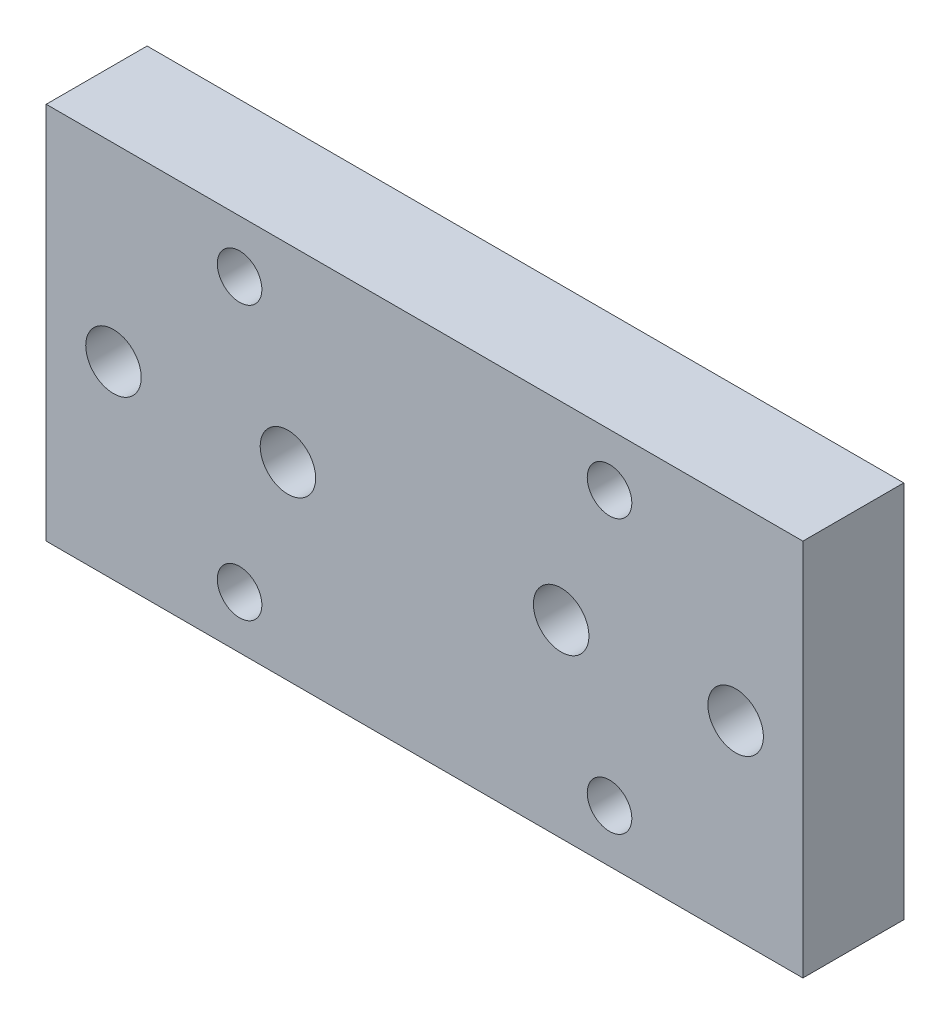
ISO-10303-21;
HEADER;
FILE_DESCRIPTION(('STEP AP214'),'2;1');
FILE_NAME('part.step','',(''),(''),'','','');
FILE_SCHEMA(('AUTOMOTIVE_DESIGN { 1 0 10303 214 1 1 1 1 }'));
ENDSEC;
DATA;
#1=APPLICATION_CONTEXT('core data for automotive mechanical design processes');
#2=APPLICATION_PROTOCOL_DEFINITION('international standard','automotive_design',2000,#1);
#3=PRODUCT_CONTEXT('',#1,'mechanical');
#4=PRODUCT('Part','Part','',(#3));
#5=PRODUCT_RELATED_PRODUCT_CATEGORY('part','',(#4));
#6=PRODUCT_DEFINITION_FORMATION('','',#4);
#7=PRODUCT_DEFINITION_CONTEXT('part definition',#1,'design');
#8=PRODUCT_DEFINITION('design','',#6,#7);
#9=PRODUCT_DEFINITION_SHAPE('','',#8);
#10=(LENGTH_UNIT() NAMED_UNIT(*) SI_UNIT(.MILLI.,.METRE.));
#11=(NAMED_UNIT(*) PLANE_ANGLE_UNIT() SI_UNIT($,.RADIAN.));
#12=(NAMED_UNIT(*) SI_UNIT($,.STERADIAN.) SOLID_ANGLE_UNIT());
#13=UNCERTAINTY_MEASURE_WITH_UNIT(LENGTH_MEASURE(1.E-05),#10,'distance_accuracy_value','');
#14=(GEOMETRIC_REPRESENTATION_CONTEXT(3) GLOBAL_UNCERTAINTY_ASSIGNED_CONTEXT((#13)) GLOBAL_UNIT_ASSIGNED_CONTEXT((#10,
#11,#12)) REPRESENTATION_CONTEXT('',''));
#15=CARTESIAN_POINT('',(0.,0.,0.));
#16=DIRECTION('',(0.,0.,1.));
#17=DIRECTION('',(1.,0.,0.));
#18=AXIS2_PLACEMENT_3D('',#15,#16,#17);
#19=CARTESIAN_POINT('',(-45.0000000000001,-22.5,12.));
#20=DIRECTION('',(0.,0.,1.));
#21=DIRECTION('',(1.,0.,0.));
#22=AXIS2_PLACEMENT_3D('',#19,#20,#21);
#23=PLANE('',#22);
#24=CARTESIAN_POINT('',(-22.,-16.25,12.));
#25=DIRECTION('',(0.,0.,-1.));
#26=DIRECTION('',(-1.,0.,0.));
#27=AXIS2_PLACEMENT_3D('',#24,#25,#26);
#28=CIRCLE('',#27,2.65);
#29=CARTESIAN_POINT('',(-24.65,-16.25,12.));
#30=VERTEX_POINT('',#29);
#31=EDGE_CURVE('E451',#30,#30,#28,.T.);
#32=ORIENTED_EDGE('',*,*,#31,.T.);
#33=EDGE_LOOP('',(#32));
#34=FACE_BOUND('',#33,.T.);
#35=CARTESIAN_POINT('',(22.,16.25,12.));
#36=DIRECTION('',(0.,0.,-1.));
#37=DIRECTION('',(-1.,0.,0.));
#38=AXIS2_PLACEMENT_3D('',#35,#36,#37);
#39=CIRCLE('',#38,2.65);
#40=CARTESIAN_POINT('',(19.35,16.25,12.));
#41=VERTEX_POINT('',#40);
#42=EDGE_CURVE('E463',#41,#41,#39,.T.);
#43=ORIENTED_EDGE('',*,*,#42,.T.);
#44=EDGE_LOOP('',(#43));
#45=FACE_BOUND('',#44,.T.);
#46=CARTESIAN_POINT('',(-37.,0.,12.));
#47=DIRECTION('',(0.,0.,-1.));
#48=DIRECTION('',(-1.,0.,0.));
#49=AXIS2_PLACEMENT_3D('',#46,#47,#48);
#50=CIRCLE('',#49,3.3);
#51=CARTESIAN_POINT('',(-40.3,0.,12.));
#52=VERTEX_POINT('',#51);
#53=EDGE_CURVE('E479',#52,#52,#50,.T.);
#54=ORIENTED_EDGE('',*,*,#53,.T.);
#55=EDGE_LOOP('',(#54));
#56=FACE_BOUND('',#55,.T.);
#57=CARTESIAN_POINT('',(16.25,0.,12.));
#58=DIRECTION('',(0.,0.,-1.));
#59=DIRECTION('',(-1.,0.,0.));
#60=AXIS2_PLACEMENT_3D('',#57,#58,#59);
#61=CIRCLE('',#60,3.3);
#62=CARTESIAN_POINT('',(12.95,0.,12.));
#63=VERTEX_POINT('',#62);
#64=EDGE_CURVE('E501',#63,#63,#61,.T.);
#65=ORIENTED_EDGE('',*,*,#64,.T.);
#66=EDGE_LOOP('',(#65));
#67=FACE_BOUND('',#66,.T.);
#68=DIRECTION('',(0.,-1.,0.));
#69=VECTOR('',#68,1.);
#70=CARTESIAN_POINT('',(-45.,22.5,12.));
#71=LINE('',#70,#69);
#72=CARTESIAN_POINT('',(-45.,22.5,12.));
#73=VERTEX_POINT('',#72);
#74=CARTESIAN_POINT('',(-45.0000000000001,-22.5,12.));
#75=VERTEX_POINT('',#74);
#76=EDGE_CURVE('E416',#73,#75,#71,.T.);
#77=ORIENTED_EDGE('',*,*,#76,.T.);
#78=DIRECTION('',(1.,0.,0.));
#79=VECTOR('',#78,1.);
#80=CARTESIAN_POINT('',(-45.0000000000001,-22.5,12.));
#81=LINE('',#80,#79);
#82=CARTESIAN_POINT('',(44.9999999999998,-22.5,12.));
#83=VERTEX_POINT('',#82);
#84=EDGE_CURVE('E401',#75,#83,#81,.T.);
#85=ORIENTED_EDGE('',*,*,#84,.T.);
#86=DIRECTION('',(0.,1.,0.));
#87=VECTOR('',#86,1.);
#88=CARTESIAN_POINT('',(45.,22.5,12.));
#89=LINE('',#88,#87);
#90=CARTESIAN_POINT('',(45.,22.5,12.));
#91=VERTEX_POINT('',#90);
#92=EDGE_CURVE('E368',#83,#91,#89,.T.);
#93=ORIENTED_EDGE('',*,*,#92,.T.);
#94=DIRECTION('',(-1.,0.,0.));
#95=VECTOR('',#94,1.);
#96=CARTESIAN_POINT('',(-45.,22.5,12.));
#97=LINE('',#96,#95);
#98=EDGE_CURVE('E363',#91,#73,#97,.T.);
#99=ORIENTED_EDGE('',*,*,#98,.T.);
#100=EDGE_LOOP('',(#77,#85,#93,#99));
#101=FACE_BOUND('',#100,.T.);
#102=CARTESIAN_POINT('',(-16.25,0.,12.));
#103=DIRECTION('',(0.,0.,-1.));
#104=DIRECTION('',(-1.,0.,0.));
#105=AXIS2_PLACEMENT_3D('',#102,#103,#104);
#106=CIRCLE('',#105,3.3);
#107=CARTESIAN_POINT('',(-19.55,0.,12.));
#108=VERTEX_POINT('',#107);
#109=EDGE_CURVE('E435',#108,#108,#106,.T.);
#110=ORIENTED_EDGE('',*,*,#109,.T.);
#111=EDGE_LOOP('',(#110));
#112=FACE_BOUND('',#111,.T.);
#113=CARTESIAN_POINT('',(37.,0.,12.));
#114=DIRECTION('',(0.,0.,-1.));
#115=DIRECTION('',(-1.,0.,0.));
#116=AXIS2_PLACEMENT_3D('',#113,#114,#115);
#117=CIRCLE('',#116,3.3);
#118=CARTESIAN_POINT('',(33.7,0.,12.));
#119=VERTEX_POINT('',#118);
#120=EDGE_CURVE('E439',#119,#119,#117,.T.);
#121=ORIENTED_EDGE('',*,*,#120,.T.);
#122=EDGE_LOOP('',(#121));
#123=FACE_BOUND('',#122,.T.);
#124=CARTESIAN_POINT('',(22.,-16.25,12.));
#125=DIRECTION('',(0.,0.,-1.));
#126=DIRECTION('',(-1.,0.,0.));
#127=AXIS2_PLACEMENT_3D('',#124,#125,#126);
#128=CIRCLE('',#127,2.65);
#129=CARTESIAN_POINT('',(19.35,-16.25,12.));
#130=VERTEX_POINT('',#129);
#131=EDGE_CURVE('E443',#130,#130,#128,.T.);
#132=ORIENTED_EDGE('',*,*,#131,.T.);
#133=EDGE_LOOP('',(#132));
#134=FACE_BOUND('',#133,.T.);
#135=CARTESIAN_POINT('',(-22.,16.25,12.));
#136=DIRECTION('',(0.,0.,-1.));
#137=DIRECTION('',(-1.,0.,0.));
#138=AXIS2_PLACEMENT_3D('',#135,#136,#137);
#139=CIRCLE('',#138,2.65);
#140=CARTESIAN_POINT('',(-24.65,16.25,12.));
#141=VERTEX_POINT('',#140);
#142=EDGE_CURVE('E446',#141,#141,#139,.T.);
#143=ORIENTED_EDGE('',*,*,#142,.T.);
#144=EDGE_LOOP('',(#143));
#145=FACE_BOUND('',#144,.T.);
#146=ADVANCED_FACE('F348',(#34,#45,#56,#67,#101,#112,#123,#134,#145),#23,.T.);
#147=CARTESIAN_POINT('',(-45.,22.5,12.));
#148=DIRECTION('',(1.,0.,0.));
#149=DIRECTION('',(0.,0.,-1.));
#150=AXIS2_PLACEMENT_3D('',#147,#148,#149);
#151=PLANE('',#150);
#152=DIRECTION('',(0.,-1.,0.));
#153=VECTOR('',#152,1.);
#154=CARTESIAN_POINT('',(-45.,22.5,0.));
#155=LINE('',#154,#153);
#156=CARTESIAN_POINT('',(-45.,22.5,0.));
#157=VERTEX_POINT('',#156);
#158=CARTESIAN_POINT('',(-45.,-22.5,0.));
#159=VERTEX_POINT('',#158);
#160=EDGE_CURVE('E393',#157,#159,#155,.T.);
#161=ORIENTED_EDGE('',*,*,#160,.T.);
#162=DIRECTION('',(0.,0.,-1.));
#163=VECTOR('',#162,1.);
#164=CARTESIAN_POINT('',(-45.0000000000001,-22.5,12.));
#165=LINE('',#164,#163);
#166=EDGE_CURVE('E11',#75,#159,#165,.T.);
#167=ORIENTED_EDGE('',*,*,#166,.F.);
#168=ORIENTED_EDGE('',*,*,#76,.F.);
#169=DIRECTION('',(0.,0.,-1.));
#170=VECTOR('',#169,1.);
#171=CARTESIAN_POINT('',(-45.,22.5,12.));
#172=LINE('',#171,#170);
#173=EDGE_CURVE('E405',#73,#157,#172,.T.);
#174=ORIENTED_EDGE('',*,*,#173,.T.);
#175=EDGE_LOOP('',(#161,#167,#168,#174));
#176=FACE_BOUND('',#175,.T.);
#177=ADVANCED_FACE('F350',(#176),#151,.F.);
#178=CARTESIAN_POINT('',(-45.0000000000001,-22.5,12.));
#179=DIRECTION('',(0.,1.,0.));
#180=DIRECTION('',(-1.,0.,0.));
#181=AXIS2_PLACEMENT_3D('',#178,#179,#180);
#182=PLANE('',#181);
#183=DIRECTION('',(1.,0.,0.));
#184=VECTOR('',#183,1.);
#185=CARTESIAN_POINT('',(-45.,-22.5,0.));
#186=LINE('',#185,#184);
#187=CARTESIAN_POINT('',(45.,-22.5,0.));
#188=VERTEX_POINT('',#187);
#189=EDGE_CURVE('E389',#159,#188,#186,.T.);
#190=ORIENTED_EDGE('',*,*,#189,.T.);
#191=DIRECTION('',(0.,0.,-1.));
#192=VECTOR('',#191,1.);
#193=CARTESIAN_POINT('',(44.9999999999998,-22.5,12.));
#194=LINE('',#193,#192);
#195=EDGE_CURVE('E356',#83,#188,#194,.T.);
#196=ORIENTED_EDGE('',*,*,#195,.F.);
#197=ORIENTED_EDGE('',*,*,#84,.F.);
#198=ORIENTED_EDGE('',*,*,#166,.T.);
#199=EDGE_LOOP('',(#190,#196,#197,#198));
#200=FACE_BOUND('',#199,.T.);
#201=ADVANCED_FACE('F400',(#200),#182,.F.);
#202=CARTESIAN_POINT('',(45.,22.5,12.));
#203=DIRECTION('',(-1.,0.,0.));
#204=DIRECTION('',(0.,0.,1.));
#205=AXIS2_PLACEMENT_3D('',#202,#203,#204);
#206=PLANE('',#205);
#207=DIRECTION('',(0.,1.,0.));
#208=VECTOR('',#207,1.);
#209=CARTESIAN_POINT('',(45.,22.5,0.));
#210=LINE('',#209,#208);
#211=CARTESIAN_POINT('',(45.,22.5,0.));
#212=VERTEX_POINT('',#211);
#213=EDGE_CURVE('E394',#188,#212,#210,.T.);
#214=ORIENTED_EDGE('',*,*,#213,.T.);
#215=DIRECTION('',(0.,0.,-1.));
#216=VECTOR('',#215,1.);
#217=CARTESIAN_POINT('',(45.,22.5,12.));
#218=LINE('',#217,#216);
#219=EDGE_CURVE('E422',#91,#212,#218,.T.);
#220=ORIENTED_EDGE('',*,*,#219,.F.);
#221=ORIENTED_EDGE('',*,*,#92,.F.);
#222=ORIENTED_EDGE('',*,*,#195,.T.);
#223=EDGE_LOOP('',(#214,#220,#221,#222));
#224=FACE_BOUND('',#223,.T.);
#225=ADVANCED_FACE('F425',(#224),#206,.F.);
#226=CARTESIAN_POINT('',(-45.,22.5,12.));
#227=DIRECTION('',(0.,-1.,0.));
#228=DIRECTION('',(1.,0.,0.));
#229=AXIS2_PLACEMENT_3D('',#226,#227,#228);
#230=PLANE('',#229);
#231=DIRECTION('',(-1.,0.,0.));
#232=VECTOR('',#231,1.);
#233=CARTESIAN_POINT('',(-45.,22.5,0.));
#234=LINE('',#233,#232);
#235=EDGE_CURVE('E414',#212,#157,#234,.T.);
#236=ORIENTED_EDGE('',*,*,#235,.T.);
#237=ORIENTED_EDGE('',*,*,#173,.F.);
#238=ORIENTED_EDGE('',*,*,#98,.F.);
#239=ORIENTED_EDGE('',*,*,#219,.T.);
#240=EDGE_LOOP('',(#236,#237,#238,#239));
#241=FACE_BOUND('',#240,.T.);
#242=ADVANCED_FACE('F427',(#241),#230,.F.);
#243=CARTESIAN_POINT('',(-45.,-22.5,0.));
#244=DIRECTION('',(0.,0.,1.));
#245=DIRECTION('',(1.,0.,0.));
#246=AXIS2_PLACEMENT_3D('',#243,#244,#245);
#247=PLANE('',#246);
#248=CARTESIAN_POINT('',(-22.,16.25,0.));
#249=DIRECTION('',(0.,0.,-1.));
#250=DIRECTION('',(-1.,0.,0.));
#251=AXIS2_PLACEMENT_3D('',#248,#249,#250);
#252=CIRCLE('',#251,2.65);
#253=CARTESIAN_POINT('',(-24.65,16.25,0.));
#254=VERTEX_POINT('',#253);
#255=EDGE_CURVE('E448',#254,#254,#252,.T.);
#256=ORIENTED_EDGE('',*,*,#255,.F.);
#257=EDGE_LOOP('',(#256));
#258=FACE_BOUND('',#257,.T.);
#259=CARTESIAN_POINT('',(-22.,-16.25,0.));
#260=DIRECTION('',(0.,0.,-1.));
#261=DIRECTION('',(-1.,0.,0.));
#262=AXIS2_PLACEMENT_3D('',#259,#260,#261);
#263=CIRCLE('',#262,2.65);
#264=CARTESIAN_POINT('',(-24.65,-16.25,0.));
#265=VERTEX_POINT('',#264);
#266=EDGE_CURVE('E456',#265,#265,#263,.T.);
#267=ORIENTED_EDGE('',*,*,#266,.F.);
#268=EDGE_LOOP('',(#267));
#269=FACE_BOUND('',#268,.T.);
#270=CARTESIAN_POINT('',(22.,-16.25,0.));
#271=DIRECTION('',(0.,0.,-1.));
#272=DIRECTION('',(-1.,0.,0.));
#273=AXIS2_PLACEMENT_3D('',#270,#271,#272);
#274=CIRCLE('',#273,2.65);
#275=CARTESIAN_POINT('',(19.35,-16.25,0.));
#276=VERTEX_POINT('',#275);
#277=EDGE_CURVE('E460',#276,#276,#274,.T.);
#278=ORIENTED_EDGE('',*,*,#277,.F.);
#279=EDGE_LOOP('',(#278));
#280=FACE_BOUND('',#279,.T.);
#281=CARTESIAN_POINT('',(22.,16.25,0.));
#282=DIRECTION('',(0.,0.,-1.));
#283=DIRECTION('',(-1.,0.,0.));
#284=AXIS2_PLACEMENT_3D('',#281,#282,#283);
#285=CIRCLE('',#284,2.65);
#286=CARTESIAN_POINT('',(19.35,16.25,0.));
#287=VERTEX_POINT('',#286);
#288=EDGE_CURVE('E466',#287,#287,#285,.T.);
#289=ORIENTED_EDGE('',*,*,#288,.F.);
#290=EDGE_LOOP('',(#289));
#291=FACE_BOUND('',#290,.T.);
#292=CARTESIAN_POINT('',(37.,0.,0.));
#293=DIRECTION('',(0.,0.,-1.));
#294=DIRECTION('',(-1.,0.,0.));
#295=AXIS2_PLACEMENT_3D('',#292,#293,#294);
#296=CIRCLE('',#295,5.49999999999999);
#297=CARTESIAN_POINT('',(31.5,0.,0.));
#298=VERTEX_POINT('',#297);
#299=EDGE_CURVE('E476',#298,#298,#296,.T.);
#300=ORIENTED_EDGE('',*,*,#299,.F.);
#301=EDGE_LOOP('',(#300));
#302=FACE_BOUND('',#301,.T.);
#303=CARTESIAN_POINT('',(-37.,0.,0.));
#304=DIRECTION('',(0.,0.,-1.));
#305=DIRECTION('',(-1.,0.,0.));
#306=AXIS2_PLACEMENT_3D('',#303,#304,#305);
#307=CIRCLE('',#306,5.49999999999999);
#308=CARTESIAN_POINT('',(-42.5,0.,0.));
#309=VERTEX_POINT('',#308);
#310=EDGE_CURVE('E488',#309,#309,#307,.T.);
#311=ORIENTED_EDGE('',*,*,#310,.F.);
#312=EDGE_LOOP('',(#311));
#313=FACE_BOUND('',#312,.T.);
#314=CARTESIAN_POINT('',(-16.25,0.,0.));
#315=DIRECTION('',(0.,0.,-1.));
#316=DIRECTION('',(-1.,0.,0.));
#317=AXIS2_PLACEMENT_3D('',#314,#315,#316);
#318=CIRCLE('',#317,5.49999999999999);
#319=CARTESIAN_POINT('',(-21.75,0.,0.));
#320=VERTEX_POINT('',#319);
#321=EDGE_CURVE('E498',#320,#320,#318,.T.);
#322=ORIENTED_EDGE('',*,*,#321,.F.);
#323=EDGE_LOOP('',(#322));
#324=FACE_BOUND('',#323,.T.);
#325=CARTESIAN_POINT('',(16.25,0.,0.));
#326=DIRECTION('',(0.,0.,-1.));
#327=DIRECTION('',(-1.,0.,0.));
#328=AXIS2_PLACEMENT_3D('',#325,#326,#327);
#329=CIRCLE('',#328,5.49999999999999);
#330=CARTESIAN_POINT('',(10.75,0.,0.));
#331=VERTEX_POINT('',#330);
#332=EDGE_CURVE('E406',#331,#331,#329,.T.);
#333=ORIENTED_EDGE('',*,*,#332,.F.);
#334=EDGE_LOOP('',(#333));
#335=FACE_BOUND('',#334,.T.);
#336=ORIENTED_EDGE('',*,*,#160,.F.);
#337=ORIENTED_EDGE('',*,*,#235,.F.);
#338=ORIENTED_EDGE('',*,*,#213,.F.);
#339=ORIENTED_EDGE('',*,*,#189,.F.);
#340=EDGE_LOOP('',(#336,#337,#338,#339));
#341=FACE_BOUND('',#340,.T.);
#342=ADVANCED_FACE('F390',(#258,#269,#280,#291,#302,#313,#324,#335,#341),#247,.F.);
#343=CARTESIAN_POINT('',(16.25,0.,0.));
#344=DIRECTION('',(0.,0.,-1.));
#345=DIRECTION('',(-1.,0.,0.));
#346=AXIS2_PLACEMENT_3D('',#343,#344,#345);
#347=CYLINDRICAL_SURFACE('',#346,5.49999999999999);
#348=CARTESIAN_POINT('',(16.25,0.,6.00000000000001));
#349=DIRECTION('',(0.,0.,-1.));
#350=DIRECTION('',(-1.,0.,0.));
#351=AXIS2_PLACEMENT_3D('',#348,#349,#350);
#352=CIRCLE('',#351,5.49999999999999);
#353=CARTESIAN_POINT('',(10.75,0.,6.00000000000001));
#354=VERTEX_POINT('',#353);
#355=EDGE_CURVE('E409',#354,#354,#352,.T.);
#356=ORIENTED_EDGE('',*,*,#355,.F.);
#357=EDGE_LOOP('',(#356));
#358=FACE_BOUND('',#357,.T.);
#359=ORIENTED_EDGE('',*,*,#332,.T.);
#360=EDGE_LOOP('',(#359));
#361=FACE_BOUND('',#360,.T.);
#362=ADVANCED_FACE('F511',(#358,#361),#347,.F.);
#363=CARTESIAN_POINT('',(19.55,0.,6.00000000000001));
#364=DIRECTION('',(0.,0.,1.));
#365=DIRECTION('',(1.,0.,0.));
#366=AXIS2_PLACEMENT_3D('',#363,#364,#365);
#367=PLANE('',#366);
#368=CARTESIAN_POINT('',(16.25,0.,6.00000000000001));
#369=DIRECTION('',(0.,0.,-1.));
#370=DIRECTION('',(-1.,0.,0.));
#371=AXIS2_PLACEMENT_3D('',#368,#369,#370);
#372=CIRCLE('',#371,3.3);
#373=CARTESIAN_POINT('',(12.95,0.,6.00000000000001));
#374=VERTEX_POINT('',#373);
#375=EDGE_CURVE('E504',#374,#374,#372,.T.);
#376=ORIENTED_EDGE('',*,*,#375,.F.);
#377=EDGE_LOOP('',(#376));
#378=FACE_BOUND('',#377,.T.);
#379=ORIENTED_EDGE('',*,*,#355,.T.);
#380=EDGE_LOOP('',(#379));
#381=FACE_BOUND('',#380,.T.);
#382=ADVANCED_FACE('F509',(#378,#381),#367,.F.);
#383=CARTESIAN_POINT('',(16.25,0.,0.));
#384=DIRECTION('',(0.,0.,-1.));
#385=DIRECTION('',(-1.,0.,0.));
#386=AXIS2_PLACEMENT_3D('',#383,#384,#385);
#387=CYLINDRICAL_SURFACE('',#386,3.3);
#388=ORIENTED_EDGE('',*,*,#64,.F.);
#389=EDGE_LOOP('',(#388));
#390=FACE_BOUND('',#389,.T.);
#391=ORIENTED_EDGE('',*,*,#375,.T.);
#392=EDGE_LOOP('',(#391));
#393=FACE_BOUND('',#392,.T.);
#394=ADVANCED_FACE('F539',(#390,#393),#387,.F.);
#395=CARTESIAN_POINT('',(-16.25,0.,0.));
#396=DIRECTION('',(0.,0.,-1.));
#397=DIRECTION('',(-1.,0.,0.));
#398=AXIS2_PLACEMENT_3D('',#395,#396,#397);
#399=CYLINDRICAL_SURFACE('',#398,5.5);
#400=CARTESIAN_POINT('',(-16.25,0.,6.00000000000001));
#401=DIRECTION('',(0.,0.,-1.));
#402=DIRECTION('',(-1.,0.,0.));
#403=AXIS2_PLACEMENT_3D('',#400,#401,#402);
#404=CIRCLE('',#403,5.5);
#405=CARTESIAN_POINT('',(-21.75,0.,6.00000000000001));
#406=VERTEX_POINT('',#405);
#407=EDGE_CURVE('E495',#406,#406,#404,.T.);
#408=ORIENTED_EDGE('',*,*,#407,.F.);
#409=EDGE_LOOP('',(#408));
#410=FACE_BOUND('',#409,.T.);
#411=ORIENTED_EDGE('',*,*,#321,.T.);
#412=EDGE_LOOP('',(#411));
#413=FACE_BOUND('',#412,.T.);
#414=ADVANCED_FACE('F544',(#410,#413),#399,.F.);
#415=CARTESIAN_POINT('',(-12.95,0.,6.00000000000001));
#416=DIRECTION('',(0.,0.,1.));
#417=DIRECTION('',(1.,0.,0.));
#418=AXIS2_PLACEMENT_3D('',#415,#416,#417);
#419=PLANE('',#418);
#420=CARTESIAN_POINT('',(-16.25,0.,6.00000000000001));
#421=DIRECTION('',(0.,0.,-1.));
#422=DIRECTION('',(-1.,0.,0.));
#423=AXIS2_PLACEMENT_3D('',#420,#421,#422);
#424=CIRCLE('',#423,3.3);
#425=CARTESIAN_POINT('',(-19.55,0.,6.00000000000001));
#426=VERTEX_POINT('',#425);
#427=EDGE_CURVE('E492',#426,#426,#424,.T.);
#428=ORIENTED_EDGE('',*,*,#427,.F.);
#429=EDGE_LOOP('',(#428));
#430=FACE_BOUND('',#429,.T.);
#431=ORIENTED_EDGE('',*,*,#407,.T.);
#432=EDGE_LOOP('',(#431));
#433=FACE_BOUND('',#432,.T.);
#434=ADVANCED_FACE('F550',(#430,#433),#419,.F.);
#435=CARTESIAN_POINT('',(-16.25,0.,0.));
#436=DIRECTION('',(0.,0.,-1.));
#437=DIRECTION('',(-1.,0.,0.));
#438=AXIS2_PLACEMENT_3D('',#435,#436,#437);
#439=CYLINDRICAL_SURFACE('',#438,3.3);
#440=ORIENTED_EDGE('',*,*,#109,.F.);
#441=EDGE_LOOP('',(#440));
#442=FACE_BOUND('',#441,.T.);
#443=ORIENTED_EDGE('',*,*,#427,.T.);
#444=EDGE_LOOP('',(#443));
#445=FACE_BOUND('',#444,.T.);
#446=ADVANCED_FACE('F556',(#442,#445),#439,.F.);
#447=CARTESIAN_POINT('',(-37.,0.,0.));
#448=DIRECTION('',(0.,0.,-1.));
#449=DIRECTION('',(-1.,0.,0.));
#450=AXIS2_PLACEMENT_3D('',#447,#448,#449);
#451=CYLINDRICAL_SURFACE('',#450,5.49999999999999);
#452=CARTESIAN_POINT('',(-37.,0.,6.00000000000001));
#453=DIRECTION('',(0.,0.,-1.));
#454=DIRECTION('',(-1.,0.,0.));
#455=AXIS2_PLACEMENT_3D('',#452,#453,#454);
#456=CIRCLE('',#455,5.5);
#457=CARTESIAN_POINT('',(-42.5,0.,6.00000000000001));
#458=VERTEX_POINT('',#457);
#459=EDGE_CURVE('E485',#458,#458,#456,.T.);
#460=ORIENTED_EDGE('',*,*,#459,.F.);
#461=EDGE_LOOP('',(#460));
#462=FACE_BOUND('',#461,.T.);
#463=ORIENTED_EDGE('',*,*,#310,.T.);
#464=EDGE_LOOP('',(#463));
#465=FACE_BOUND('',#464,.T.);
#466=ADVANCED_FACE('F562',(#462,#465),#451,.F.);
#467=CARTESIAN_POINT('',(-33.7,0.,6.00000000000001));
#468=DIRECTION('',(0.,0.,1.));
#469=DIRECTION('',(1.,0.,0.));
#470=AXIS2_PLACEMENT_3D('',#467,#468,#469);
#471=PLANE('',#470);
#472=CARTESIAN_POINT('',(-37.,0.,6.00000000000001));
#473=DIRECTION('',(0.,0.,-1.));
#474=DIRECTION('',(-1.,0.,0.));
#475=AXIS2_PLACEMENT_3D('',#472,#473,#474);
#476=CIRCLE('',#475,3.3);
#477=CARTESIAN_POINT('',(-40.3,0.,6.00000000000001));
#478=VERTEX_POINT('',#477);
#479=EDGE_CURVE('E482',#478,#478,#476,.T.);
#480=ORIENTED_EDGE('',*,*,#479,.F.);
#481=EDGE_LOOP('',(#480));
#482=FACE_BOUND('',#481,.T.);
#483=ORIENTED_EDGE('',*,*,#459,.T.);
#484=EDGE_LOOP('',(#483));
#485=FACE_BOUND('',#484,.T.);
#486=ADVANCED_FACE('F568',(#482,#485),#471,.F.);
#487=CARTESIAN_POINT('',(-37.,0.,0.));
#488=DIRECTION('',(0.,0.,-1.));
#489=DIRECTION('',(-1.,0.,0.));
#490=AXIS2_PLACEMENT_3D('',#487,#488,#489);
#491=CYLINDRICAL_SURFACE('',#490,3.3);
#492=ORIENTED_EDGE('',*,*,#53,.F.);
#493=EDGE_LOOP('',(#492));
#494=FACE_BOUND('',#493,.T.);
#495=ORIENTED_EDGE('',*,*,#479,.T.);
#496=EDGE_LOOP('',(#495));
#497=FACE_BOUND('',#496,.T.);
#498=ADVANCED_FACE('F574',(#494,#497),#491,.F.);
#499=CARTESIAN_POINT('',(37.,0.,0.));
#500=DIRECTION('',(0.,0.,-1.));
#501=DIRECTION('',(-1.,0.,0.));
#502=AXIS2_PLACEMENT_3D('',#499,#500,#501);
#503=CYLINDRICAL_SURFACE('',#502,5.49999999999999);
#504=CARTESIAN_POINT('',(37.,0.,6.00000000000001));
#505=DIRECTION('',(0.,0.,-1.));
#506=DIRECTION('',(-1.,0.,0.));
#507=AXIS2_PLACEMENT_3D('',#504,#505,#506);
#508=CIRCLE('',#507,5.5);
#509=CARTESIAN_POINT('',(31.5,0.,6.00000000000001));
#510=VERTEX_POINT('',#509);
#511=EDGE_CURVE('E473',#510,#510,#508,.T.);
#512=ORIENTED_EDGE('',*,*,#511,.F.);
#513=EDGE_LOOP('',(#512));
#514=FACE_BOUND('',#513,.T.);
#515=ORIENTED_EDGE('',*,*,#299,.T.);
#516=EDGE_LOOP('',(#515));
#517=FACE_BOUND('',#516,.T.);
#518=ADVANCED_FACE('F580',(#514,#517),#503,.F.);
#519=CARTESIAN_POINT('',(40.3,0.,6.00000000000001));
#520=DIRECTION('',(0.,0.,1.));
#521=DIRECTION('',(1.,0.,0.));
#522=AXIS2_PLACEMENT_3D('',#519,#520,#521);
#523=PLANE('',#522);
#524=CARTESIAN_POINT('',(37.,0.,6.00000000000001));
#525=DIRECTION('',(0.,0.,-1.));
#526=DIRECTION('',(-1.,0.,0.));
#527=AXIS2_PLACEMENT_3D('',#524,#525,#526);
#528=CIRCLE('',#527,3.3);
#529=CARTESIAN_POINT('',(33.7,0.,6.00000000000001));
#530=VERTEX_POINT('',#529);
#531=EDGE_CURVE('E470',#530,#530,#528,.T.);
#532=ORIENTED_EDGE('',*,*,#531,.F.);
#533=EDGE_LOOP('',(#532));
#534=FACE_BOUND('',#533,.T.);
#535=ORIENTED_EDGE('',*,*,#511,.T.);
#536=EDGE_LOOP('',(#535));
#537=FACE_BOUND('',#536,.T.);
#538=ADVANCED_FACE('F586',(#534,#537),#523,.F.);
#539=CARTESIAN_POINT('',(37.,0.,0.));
#540=DIRECTION('',(0.,0.,-1.));
#541=DIRECTION('',(-1.,0.,0.));
#542=AXIS2_PLACEMENT_3D('',#539,#540,#541);
#543=CYLINDRICAL_SURFACE('',#542,3.3);
#544=ORIENTED_EDGE('',*,*,#120,.F.);
#545=EDGE_LOOP('',(#544));
#546=FACE_BOUND('',#545,.T.);
#547=ORIENTED_EDGE('',*,*,#531,.T.);
#548=EDGE_LOOP('',(#547));
#549=FACE_BOUND('',#548,.T.);
#550=ADVANCED_FACE('F592',(#546,#549),#543,.F.);
#551=CARTESIAN_POINT('',(22.,16.25,0.));
#552=DIRECTION('',(0.,0.,-1.));
#553=DIRECTION('',(-1.,0.,0.));
#554=AXIS2_PLACEMENT_3D('',#551,#552,#553);
#555=CYLINDRICAL_SURFACE('',#554,2.65);
#556=ORIENTED_EDGE('',*,*,#42,.F.);
#557=EDGE_LOOP('',(#556));
#558=FACE_BOUND('',#557,.T.);
#559=ORIENTED_EDGE('',*,*,#288,.T.);
#560=EDGE_LOOP('',(#559));
#561=FACE_BOUND('',#560,.T.);
#562=ADVANCED_FACE('F597',(#558,#561),#555,.F.);
#563=CARTESIAN_POINT('',(22.,-16.25,0.));
#564=DIRECTION('',(0.,0.,-1.));
#565=DIRECTION('',(-1.,0.,0.));
#566=AXIS2_PLACEMENT_3D('',#563,#564,#565);
#567=CYLINDRICAL_SURFACE('',#566,2.65);
#568=ORIENTED_EDGE('',*,*,#131,.F.);
#569=EDGE_LOOP('',(#568));
#570=FACE_BOUND('',#569,.T.);
#571=ORIENTED_EDGE('',*,*,#277,.T.);
#572=EDGE_LOOP('',(#571));
#573=FACE_BOUND('',#572,.T.);
#574=ADVANCED_FACE('F606',(#570,#573),#567,.F.);
#575=CARTESIAN_POINT('',(-22.,-16.25,0.));
#576=DIRECTION('',(0.,0.,-1.));
#577=DIRECTION('',(-1.,0.,0.));
#578=AXIS2_PLACEMENT_3D('',#575,#576,#577);
#579=CYLINDRICAL_SURFACE('',#578,2.65);
#580=ORIENTED_EDGE('',*,*,#31,.F.);
#581=EDGE_LOOP('',(#580));
#582=FACE_BOUND('',#581,.T.);
#583=ORIENTED_EDGE('',*,*,#266,.T.);
#584=EDGE_LOOP('',(#583));
#585=FACE_BOUND('',#584,.T.);
#586=ADVANCED_FACE('F612',(#582,#585),#579,.F.);
#587=CARTESIAN_POINT('',(-22.,16.25,0.));
#588=DIRECTION('',(0.,0.,-1.));
#589=DIRECTION('',(-1.,0.,0.));
#590=AXIS2_PLACEMENT_3D('',#587,#588,#589);
#591=CYLINDRICAL_SURFACE('',#590,2.65);
#592=ORIENTED_EDGE('',*,*,#142,.F.);
#593=EDGE_LOOP('',(#592));
#594=FACE_BOUND('',#593,.T.);
#595=ORIENTED_EDGE('',*,*,#255,.T.);
#596=EDGE_LOOP('',(#595));
#597=FACE_BOUND('',#596,.T.);
#598=ADVANCED_FACE('F618',(#594,#597),#591,.F.);
#599=CLOSED_SHELL('',(#146,#177,#201,#225,#242,#342,#362,#382,#394,#414,#434,#446,#466,#486,
#498,#518,#538,#550,#562,#574,#586,#598));
#600=MANIFOLD_SOLID_BREP('B2',#599);
#601=ADVANCED_BREP_SHAPE_REPRESENTATION('',(#18,#600),#14);
#602=SHAPE_DEFINITION_REPRESENTATION(#9,#601);
ENDSEC;
END-ISO-10303-21;
